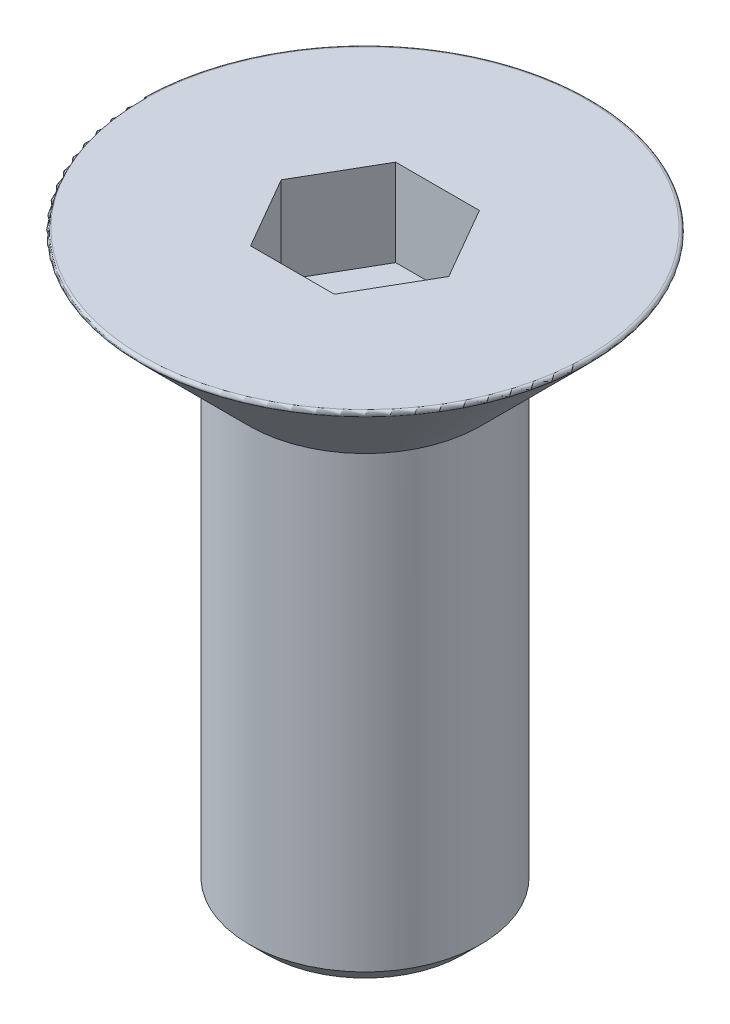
from build123d import *

# Parameters (mm, degrees)
ENL_V_MAT_EXTRU_1_DEPTH = 3
CHANFREIN1_SIZE         = 0.625
CONG_1_R                = 0.1


with BuildPart() as part:
    # Esquisse1 → Base-R_volution (revolve)
    with BuildSketch(Plane.XY, mode=Mode.PRIVATE) as base_r_volution_sk:
        Polygon((0, 0), (7.9, 0), (4, -3.9), (4, -20), (0, -20), align=None)
    revolve(base_r_volution_sk.sketch.rotate(Axis((0, 18.020251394, 0), (0, -1, 0)), 90), axis=Axis((0, 18.020251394, 0), (0, -1, 0)))

    # Esquisse2 → Enl_v. mat.-Extru.1 (cut)
    with BuildSketch(Plane(origin=(-0.418409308, 0, 2.094233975), x_dir=(-1, 0, 0), z_dir=(0, 1, 0))):
        Polygon((1.024966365, 0.405766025), (2.468342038, -2.094233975), (1.024966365, -4.594233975), (-1.861784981, -4.594233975), (-3.305160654, -2.094233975), (-1.861784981, 0.405766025), align=None)
    extrude(amount=-ENL_V_MAT_EXTRU_1_DEPTH, mode=Mode.SUBTRACT)

    # Chanfrein1
    chanfrein1_edges = [part.edges().sort_by_distance(p)[0] for p in [
        (0, -20, -4),
    ]]
    chamfer(chanfrein1_edges, length=CHANFREIN1_SIZE)

    # Cong_1
    cong_1_edges = [part.edges().sort_by_distance(p)[0] for p in [
        (0, 0, -7.9),
    ]]
    fillet(cong_1_edges, radius=CONG_1_R)


solid = part.part
